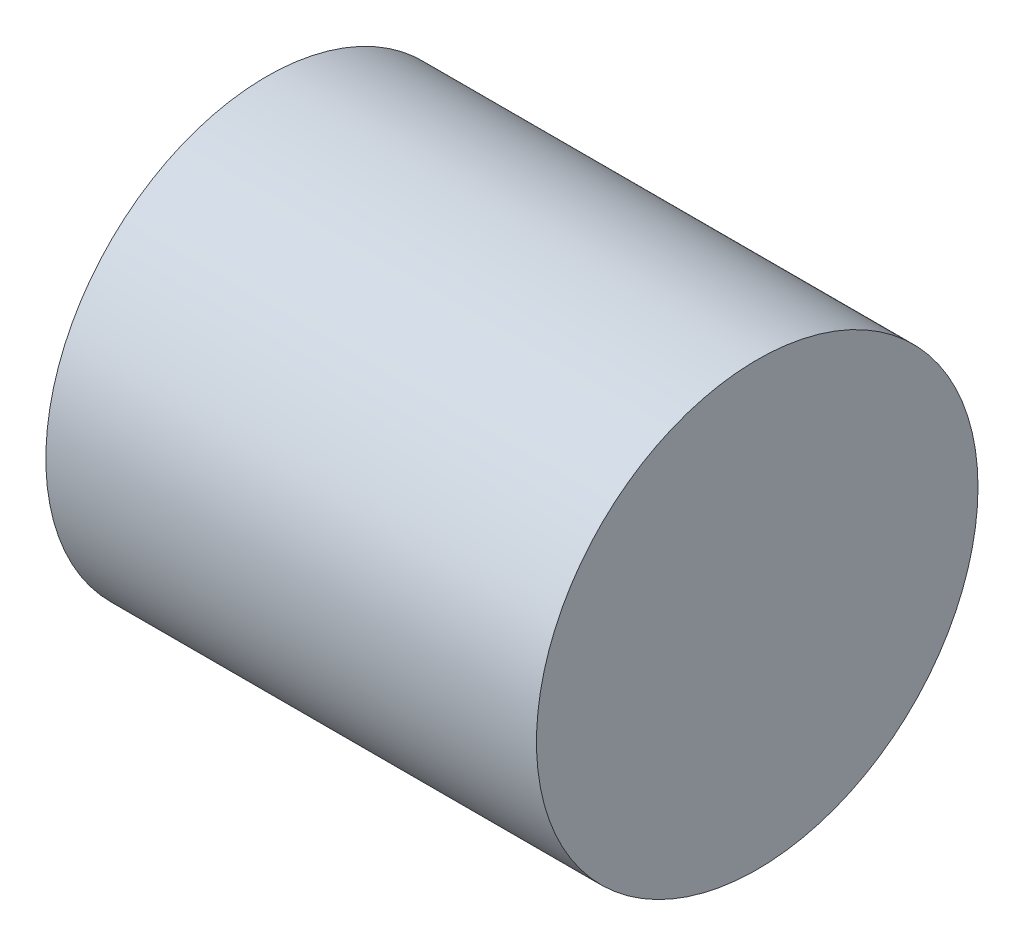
from build123d import *

# Parameters (mm, degrees)
SKETCH1_R      = 9
EXTRUDE1_DEPTH = 20


with BuildPart() as part:
    # Sketch1 → Extrude1 (new body)
    with BuildSketch(Plane(origin=(0, 0, 0), x_dir=(0, 0, -1), z_dir=(1, 0, 0))):
        Circle(SKETCH1_R)
    extrude(amount=EXTRUDE1_DEPTH)


solid = part.part
